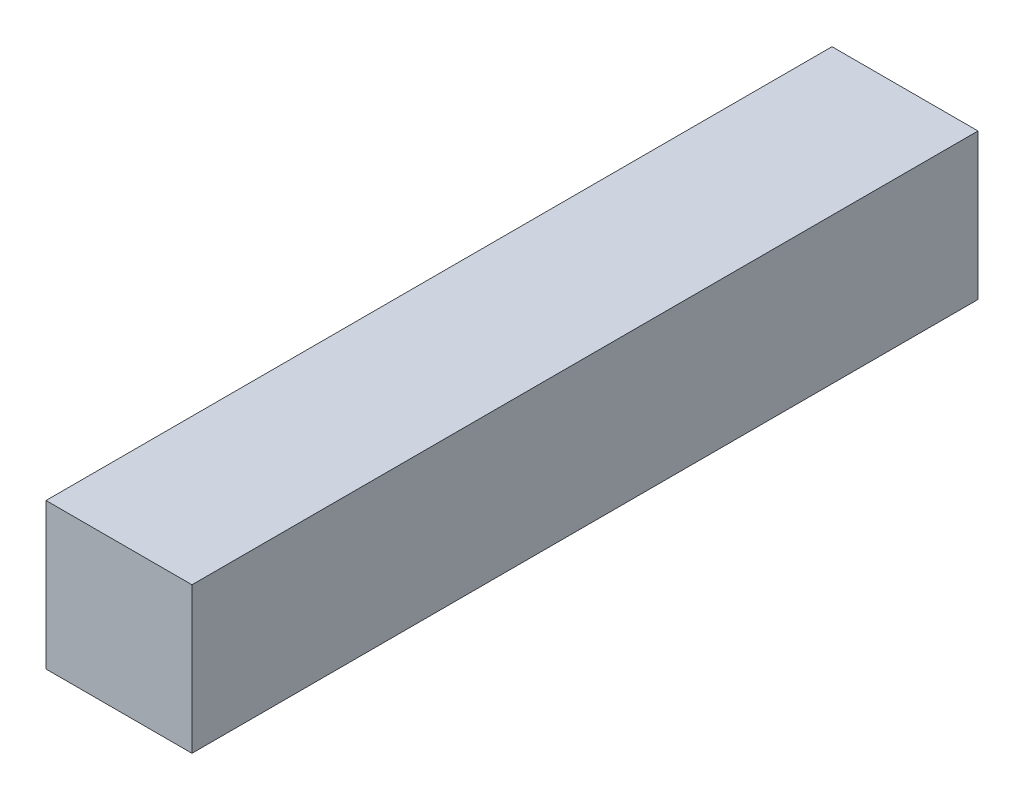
from build123d import *

# Parameters (mm, degrees)
ESQUISSE1_W      = 13
ESQUISSE1_H      = 13
EXTRUSION1_DEPTH = 35


with BuildPart() as part:
    # Esquisse1 → Extrusion1 (new, symmetric)
    with BuildSketch(Plane.XY):
        Rectangle(ESQUISSE1_W, ESQUISSE1_H)
    extrude(amount=EXTRUSION1_DEPTH, both=True)


solid = part.part
